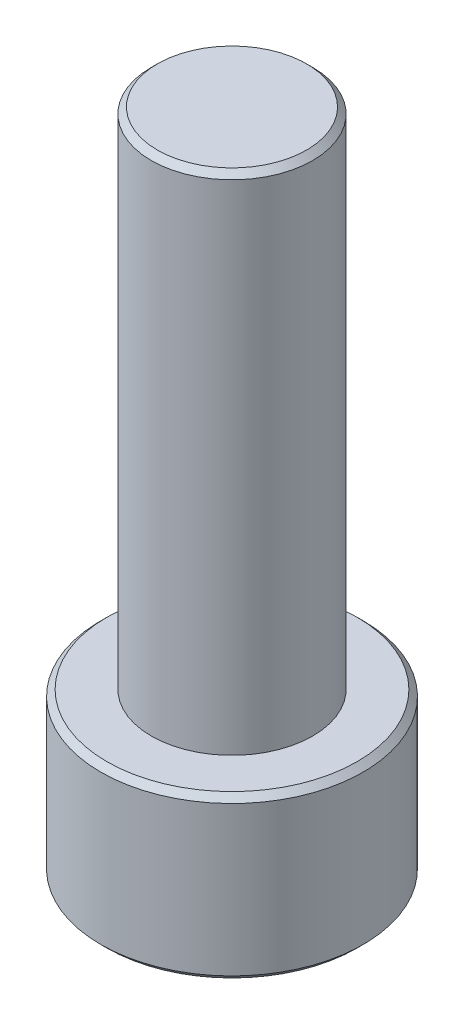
from build123d import *

# Parameters (mm, degrees)
SKETCH1_R           = 6.5
BOSS_EXTRUDE1_DEPTH = 8
SKETCH2_R           = 4
BOSS_EXTRUDE2_DEPTH = 25
CHAMFER1_SIZE       = 0.3
CHAMFER2_SIZE       = 0.3
CUT_EXTRUDE1_DEPTH  = 3


with BuildPart() as part:
    # Sketch1 → Boss-Extrude1 (new body)
    with BuildSketch(Plane(origin=(0, 0, 0), x_dir=(1, 0, 0), z_dir=(0, 1, 0))):
        with Locations(Location((0, 0, 0), (0, 0, 270))):
            Circle(SKETCH1_R)
    extrude(amount=BOSS_EXTRUDE1_DEPTH)

    # Sketch2 → Boss-Extrude2 (add)
    with BuildSketch(Plane(origin=(0, 8, 0), x_dir=(1, 0, 0), z_dir=(0, 1, 0))):
        with Locations(Location((0, 0, 0), (0, 0, 270))):
            Circle(SKETCH2_R)
    extrude(amount=BOSS_EXTRUDE2_DEPTH)

    # Chamfer1
    chamfer1_edges = [part.edges().sort_by_distance(p)[0] for p in [
        (0, 0, -6.5),
        (0, 8, -6.5),
    ]]
    chamfer(chamfer1_edges, length=CHAMFER1_SIZE)

    # Chamfer2
    chamfer2_edges = [part.edges().sort_by_distance(p)[0] for p in [
        (0, 33, -4),
    ]]
    chamfer(chamfer2_edges, length=CHAMFER2_SIZE)

    # Sketch3 → Cut-Extrude1 (cut)
    with BuildSketch(Plane.XZ):
        Polygon((3.521836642, 0), (1.760918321, 3.05), (-1.760918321, 3.05), (-3.521836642, 0), (-1.760918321, -3.05), (1.760918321, -3.05), align=None)
    extrude(amount=-CUT_EXTRUDE1_DEPTH, mode=Mode.SUBTRACT)


solid = part.part
